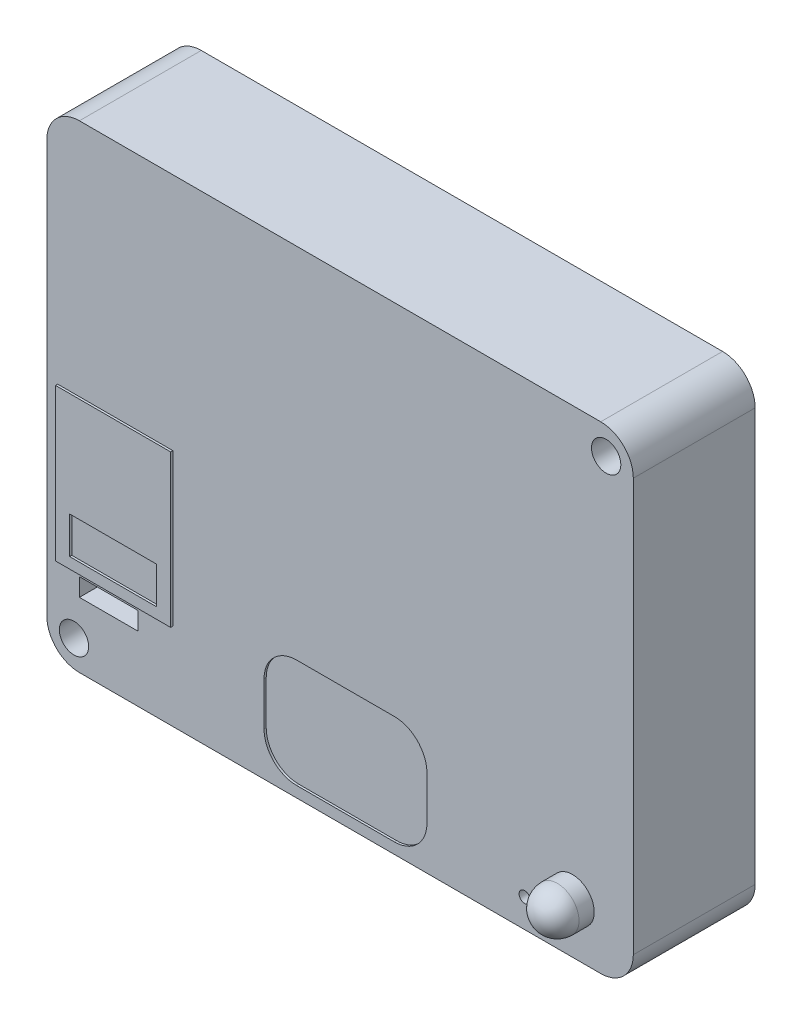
ISO-10303-21;
HEADER;
FILE_DESCRIPTION(('STEP AP214'),'2;1');
FILE_NAME('part.step','',(''),(''),'','','');
FILE_SCHEMA(('AUTOMOTIVE_DESIGN { 1 0 10303 214 1 1 1 1 }'));
ENDSEC;
DATA;
#1=APPLICATION_CONTEXT('core data for automotive mechanical design processes');
#2=APPLICATION_PROTOCOL_DEFINITION('international standard','automotive_design',2000,#1);
#3=PRODUCT_CONTEXT('',#1,'mechanical');
#4=PRODUCT('Part','Part','',(#3));
#5=PRODUCT_RELATED_PRODUCT_CATEGORY('part','',(#4));
#6=PRODUCT_DEFINITION_FORMATION('','',#4);
#7=PRODUCT_DEFINITION_CONTEXT('part definition',#1,'design');
#8=PRODUCT_DEFINITION('design','',#6,#7);
#9=PRODUCT_DEFINITION_SHAPE('','',#8);
#10=(LENGTH_UNIT() NAMED_UNIT(*) SI_UNIT(.MILLI.,.METRE.));
#11=(NAMED_UNIT(*) PLANE_ANGLE_UNIT() SI_UNIT($,.RADIAN.));
#12=(NAMED_UNIT(*) SI_UNIT($,.STERADIAN.) SOLID_ANGLE_UNIT());
#13=UNCERTAINTY_MEASURE_WITH_UNIT(LENGTH_MEASURE(1.E-05),#10,'distance_accuracy_value','');
#14=(GEOMETRIC_REPRESENTATION_CONTEXT(3) GLOBAL_UNCERTAINTY_ASSIGNED_CONTEXT((#13)) GLOBAL_UNIT_ASSIGNED_CONTEXT((#10,
#11,#12)) REPRESENTATION_CONTEXT('',''));
#15=CARTESIAN_POINT('',(0.,0.,0.));
#16=DIRECTION('',(0.,0.,1.));
#17=DIRECTION('',(1.,0.,0.));
#18=AXIS2_PLACEMENT_3D('',#15,#16,#17);
#19=CARTESIAN_POINT('',(0.,0.,14.2494));
#20=DIRECTION('',(0.,0.,1.));
#21=DIRECTION('',(1.,0.,0.));
#22=AXIS2_PLACEMENT_3D('',#19,#20,#21);
#23=PLANE('',#22);
#24=CARTESIAN_POINT('',(16.2602479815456,25.4739734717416,14.2494));
#25=DIRECTION('',(0.,0.,1.));
#26=DIRECTION('',(1.,0.,0.));
#27=AXIS2_PLACEMENT_3D('',#24,#25,#26);
#28=CIRCLE('',#27,1.7145);
#29=CARTESIAN_POINT('',(17.9747479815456,25.4739734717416,14.2494));
#30=VERTEX_POINT('',#29);
#31=EDGE_CURVE('E275',#30,#30,#28,.F.);
#32=ORIENTED_EDGE('',*,*,#31,.T.);
#33=EDGE_LOOP('',(#32));
#34=FACE_BOUND('',#33,.T.);
#35=CARTESIAN_POINT('',(6.73524798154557,-23.9290265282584,14.2494));
#36=DIRECTION('',(0.,0.,1.));
#37=DIRECTION('',(1.,0.,0.));
#38=AXIS2_PLACEMENT_3D('',#35,#36,#37);
#39=CIRCLE('',#38,0.65532019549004);
#40=CARTESIAN_POINT('',(7.39056817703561,-23.9290265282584,14.2494));
#41=VERTEX_POINT('',#40);
#42=EDGE_CURVE('E269',#41,#41,#39,.F.);
#43=ORIENTED_EDGE('',*,*,#42,.T.);
#44=EDGE_LOOP('',(#43));
#45=FACE_BOUND('',#44,.T.);
#46=CARTESIAN_POINT('',(-19.9347520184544,-17.0710265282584,14.2494));
#47=DIRECTION('',(0.,0.,1.));
#48=DIRECTION('',(1.,0.,0.));
#49=AXIS2_PLACEMENT_3D('',#46,#47,#48);
#50=CIRCLE('',#49,3.81);
#51=CARTESIAN_POINT('',(-23.7447520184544,-17.0710265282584,14.2494));
#52=VERTEX_POINT('',#51);
#53=CARTESIAN_POINT('',(-19.9347520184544,-13.2610265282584,14.2494));
#54=VERTEX_POINT('',#53);
#55=EDGE_CURVE('E260',#52,#54,#50,.F.);
#56=ORIENTED_EDGE('',*,*,#55,.T.);
#57=DIRECTION('',(1.,0.,0.));
#58=VECTOR('',#57,1.);
#59=CARTESIAN_POINT('',(-23.7447520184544,-13.2610265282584,14.2494));
#60=LINE('',#59,#58);
#61=CARTESIAN_POINT('',(-8.50475201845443,-13.2610265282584,14.2494));
#62=VERTEX_POINT('',#61);
#63=EDGE_CURVE('E256',#54,#62,#60,.T.);
#64=ORIENTED_EDGE('',*,*,#63,.T.);
#65=CARTESIAN_POINT('',(-8.50475201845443,-17.0710265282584,14.2494));
#66=DIRECTION('',(0.,0.,1.));
#67=DIRECTION('',(1.,0.,0.));
#68=AXIS2_PLACEMENT_3D('',#65,#66,#67);
#69=CIRCLE('',#68,3.81);
#70=CARTESIAN_POINT('',(-4.69475201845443,-17.0710265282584,14.2494));
#71=VERTEX_POINT('',#70);
#72=EDGE_CURVE('E254',#62,#71,#69,.F.);
#73=ORIENTED_EDGE('',*,*,#72,.T.);
#74=DIRECTION('',(0.,-1.,0.));
#75=VECTOR('',#74,1.);
#76=CARTESIAN_POINT('',(-4.69475201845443,-13.2610265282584,14.2494));
#77=LINE('',#76,#75);
#78=CARTESIAN_POINT('',(-4.69475201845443,-22.1510265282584,14.2494));
#79=VERTEX_POINT('',#78);
#80=EDGE_CURVE('E250',#71,#79,#77,.T.);
#81=ORIENTED_EDGE('',*,*,#80,.T.);
#82=CARTESIAN_POINT('',(-8.50475201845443,-22.1510265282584,14.2494));
#83=DIRECTION('',(0.,0.,1.));
#84=DIRECTION('',(1.,0.,0.));
#85=AXIS2_PLACEMENT_3D('',#82,#83,#84);
#86=CIRCLE('',#85,3.81);
#87=CARTESIAN_POINT('',(-8.50475201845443,-25.9610265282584,14.2494));
#88=VERTEX_POINT('',#87);
#89=EDGE_CURVE('E11',#79,#88,#86,.F.);
#90=ORIENTED_EDGE('',*,*,#89,.T.);
#91=DIRECTION('',(-1.,0.,0.));
#92=VECTOR('',#91,1.);
#93=CARTESIAN_POINT('',(-23.7447520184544,-25.9610265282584,14.2494));
#94=LINE('',#93,#92);
#95=CARTESIAN_POINT('',(-19.9347520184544,-25.9610265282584,14.2494));
#96=VERTEX_POINT('',#95);
#97=EDGE_CURVE('E248',#88,#96,#94,.T.);
#98=ORIENTED_EDGE('',*,*,#97,.T.);
#99=CARTESIAN_POINT('',(-19.9347520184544,-22.1510265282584,14.2494));
#100=DIRECTION('',(0.,0.,1.));
#101=DIRECTION('',(1.,0.,0.));
#102=AXIS2_PLACEMENT_3D('',#99,#100,#101);
#103=CIRCLE('',#102,3.81);
#104=CARTESIAN_POINT('',(-23.7447520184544,-22.1510265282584,14.2494));
#105=VERTEX_POINT('',#104);
#106=EDGE_CURVE('E252',#96,#105,#103,.F.);
#107=ORIENTED_EDGE('',*,*,#106,.T.);
#108=DIRECTION('',(0.,1.,0.));
#109=VECTOR('',#108,1.);
#110=CARTESIAN_POINT('',(-23.7447520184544,-13.2610265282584,14.2494));
#111=LINE('',#110,#109);
#112=EDGE_CURVE('E258',#105,#52,#111,.T.);
#113=ORIENTED_EDGE('',*,*,#112,.T.);
#114=EDGE_LOOP('',(#56,#64,#73,#81,#90,#98,#107,#113));
#115=FACE_BOUND('',#114,.T.);
#116=DIRECTION('',(-1.,0.,0.));
#117=VECTOR('',#116,1.);
#118=CARTESIAN_POINT('',(-47.8747520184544,0.70897347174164,14.2494));
#119=LINE('',#118,#117);
#120=CARTESIAN_POINT('',(-34.4127520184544,0.70897347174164,14.2494));
#121=VERTEX_POINT('',#120);
#122=CARTESIAN_POINT('',(-47.8747520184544,0.70897347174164,14.2494));
#123=VERTEX_POINT('',#122);
#124=EDGE_CURVE('E222',#121,#123,#119,.T.);
#125=ORIENTED_EDGE('',*,*,#124,.F.);
#126=DIRECTION('',(0.,1.,0.));
#127=VECTOR('',#126,1.);
#128=CARTESIAN_POINT('',(-34.4127520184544,-17.0710265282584,14.2494));
#129=LINE('',#128,#127);
#130=CARTESIAN_POINT('',(-34.4127520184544,-17.0710265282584,14.2494));
#131=VERTEX_POINT('',#130);
#132=EDGE_CURVE('E215',#131,#121,#129,.T.);
#133=ORIENTED_EDGE('',*,*,#132,.F.);
#134=DIRECTION('',(1.,0.,0.));
#135=VECTOR('',#134,1.);
#136=CARTESIAN_POINT('',(-47.8747520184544,-17.0710265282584,14.2494));
#137=LINE('',#136,#135);
#138=CARTESIAN_POINT('',(-47.8747520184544,-17.0710265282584,14.2494));
#139=VERTEX_POINT('',#138);
#140=EDGE_CURVE('E219',#139,#131,#137,.T.);
#141=ORIENTED_EDGE('',*,*,#140,.F.);
#142=DIRECTION('',(0.,-1.,0.));
#143=VECTOR('',#142,1.);
#144=CARTESIAN_POINT('',(-47.8747520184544,-17.0710265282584,14.2494));
#145=LINE('',#144,#143);
#146=EDGE_CURVE('E234',#123,#139,#145,.T.);
#147=ORIENTED_EDGE('',*,*,#146,.F.);
#148=EDGE_LOOP('',(#125,#133,#141,#147));
#149=FACE_BOUND('',#148,.T.);
#150=DIRECTION('',(0.,-1.,0.));
#151=VECTOR('',#150,1.);
#152=CARTESIAN_POINT('',(19.4352479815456,-27.2310265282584,14.2494));
#153=LINE('',#152,#151);
#154=CARTESIAN_POINT('',(19.4352479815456,24.8389734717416,14.2494));
#155=VERTEX_POINT('',#154);
#156=CARTESIAN_POINT('',(19.4352479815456,-23.4210265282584,14.2494));
#157=VERTEX_POINT('',#156);
#158=EDGE_CURVE('E404',#155,#157,#153,.T.);
#159=ORIENTED_EDGE('',*,*,#158,.F.);
#160=CARTESIAN_POINT('',(15.6252479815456,24.8389734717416,14.2494));
#161=DIRECTION('',(0.,0.,-1.));
#162=DIRECTION('',(-1.,0.,0.));
#163=AXIS2_PLACEMENT_3D('',#160,#161,#162);
#164=CIRCLE('',#163,3.81);
#165=CARTESIAN_POINT('',(15.6252479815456,28.6489734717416,14.2494));
#166=VERTEX_POINT('',#165);
#167=EDGE_CURVE('E401',#166,#155,#164,.T.);
#168=ORIENTED_EDGE('',*,*,#167,.F.);
#169=DIRECTION('',(1.,0.,0.));
#170=VECTOR('',#169,1.);
#171=CARTESIAN_POINT('',(-49.1447520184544,28.6489734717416,14.2494));
#172=LINE('',#171,#170);
#173=CARTESIAN_POINT('',(-45.3347520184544,28.6489734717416,14.2494));
#174=VERTEX_POINT('',#173);
#175=EDGE_CURVE('E398',#174,#166,#172,.T.);
#176=ORIENTED_EDGE('',*,*,#175,.F.);
#177=CARTESIAN_POINT('',(-45.3347520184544,24.8389734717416,14.2494));
#178=DIRECTION('',(0.,0.,-1.));
#179=DIRECTION('',(-1.,0.,0.));
#180=AXIS2_PLACEMENT_3D('',#177,#178,#179);
#181=CIRCLE('',#180,3.81);
#182=CARTESIAN_POINT('',(-49.1447520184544,24.8389734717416,14.2494));
#183=VERTEX_POINT('',#182);
#184=EDGE_CURVE('E395',#183,#174,#181,.T.);
#185=ORIENTED_EDGE('',*,*,#184,.F.);
#186=DIRECTION('',(0.,1.,0.));
#187=VECTOR('',#186,1.);
#188=CARTESIAN_POINT('',(-49.1447520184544,-27.2310265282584,14.2494));
#189=LINE('',#188,#187);
#190=CARTESIAN_POINT('',(-49.1447520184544,-23.4210265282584,14.2494));
#191=VERTEX_POINT('',#190);
#192=EDGE_CURVE('E416',#191,#183,#189,.T.);
#193=ORIENTED_EDGE('',*,*,#192,.F.);
#194=CARTESIAN_POINT('',(-45.3347520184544,-23.4210265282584,14.2494));
#195=DIRECTION('',(0.,0.,-1.));
#196=DIRECTION('',(-1.,0.,0.));
#197=AXIS2_PLACEMENT_3D('',#194,#195,#196);
#198=CIRCLE('',#197,3.81);
#199=CARTESIAN_POINT('',(-45.3347520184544,-27.2310265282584,14.2494));
#200=VERTEX_POINT('',#199);
#201=EDGE_CURVE('E413',#200,#191,#198,.T.);
#202=ORIENTED_EDGE('',*,*,#201,.F.);
#203=DIRECTION('',(-1.,0.,0.));
#204=VECTOR('',#203,1.);
#205=CARTESIAN_POINT('',(-49.1447520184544,-27.2310265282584,14.2494));
#206=LINE('',#205,#204);
#207=CARTESIAN_POINT('',(15.6252479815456,-27.2310265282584,14.2494));
#208=VERTEX_POINT('',#207);
#209=EDGE_CURVE('E410',#208,#200,#206,.T.);
#210=ORIENTED_EDGE('',*,*,#209,.F.);
#211=CARTESIAN_POINT('',(15.6252479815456,-23.4210265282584,14.2494));
#212=DIRECTION('',(0.,0.,-1.));
#213=DIRECTION('',(-1.,0.,0.));
#214=AXIS2_PLACEMENT_3D('',#211,#212,#213);
#215=CIRCLE('',#214,3.81);
#216=EDGE_CURVE('E407',#157,#208,#215,.T.);
#217=ORIENTED_EDGE('',*,*,#216,.F.);
#218=EDGE_LOOP('',(#159,#168,#176,#185,#193,#202,#210,#217));
#219=FACE_BOUND('',#218,.T.);
#220=DIRECTION('',(0.,1.,0.));
#221=VECTOR('',#220,1.);
#222=CARTESIAN_POINT('',(-45.3347520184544,-17.5155265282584,14.2494));
#223=LINE('',#222,#221);
#224=CARTESIAN_POINT('',(-45.3347520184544,-19.6110265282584,14.2494));
#225=VERTEX_POINT('',#224);
#226=CARTESIAN_POINT('',(-45.3347520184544,-17.5155265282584,14.2494));
#227=VERTEX_POINT('',#226);
#228=EDGE_CURVE('E267',#225,#227,#223,.T.);
#229=ORIENTED_EDGE('',*,*,#228,.T.);
#230=DIRECTION('',(1.,0.,0.));
#231=VECTOR('',#230,1.);
#232=CARTESIAN_POINT('',(-45.3347520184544,-17.5155265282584,14.2494));
#233=LINE('',#232,#231);
#234=CARTESIAN_POINT('',(-38.4767520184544,-17.5155265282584,14.2494));
#235=VERTEX_POINT('',#234);
#236=EDGE_CURVE('E265',#227,#235,#233,.T.);
#237=ORIENTED_EDGE('',*,*,#236,.T.);
#238=DIRECTION('',(0.,-1.,0.));
#239=VECTOR('',#238,1.);
#240=CARTESIAN_POINT('',(-38.4767520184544,-17.5155265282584,14.2494));
#241=LINE('',#240,#239);
#242=CARTESIAN_POINT('',(-38.4767520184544,-19.6110265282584,14.2494));
#243=VERTEX_POINT('',#242);
#244=EDGE_CURVE('E52',#235,#243,#241,.T.);
#245=ORIENTED_EDGE('',*,*,#244,.T.);
#246=DIRECTION('',(-1.,0.,0.));
#247=VECTOR('',#246,1.);
#248=CARTESIAN_POINT('',(-45.3347520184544,-19.6110265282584,14.2494));
#249=LINE('',#248,#247);
#250=EDGE_CURVE('E262',#243,#225,#249,.T.);
#251=ORIENTED_EDGE('',*,*,#250,.T.);
#252=EDGE_LOOP('',(#229,#237,#245,#251));
#253=FACE_BOUND('',#252,.T.);
#254=CARTESIAN_POINT('',(-45.9697520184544,-24.0560265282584,14.2494));
#255=DIRECTION('',(0.,0.,1.));
#256=DIRECTION('',(1.,0.,0.));
#257=AXIS2_PLACEMENT_3D('',#254,#255,#256);
#258=CIRCLE('',#257,1.7145);
#259=CARTESIAN_POINT('',(-44.2552520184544,-24.0560265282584,14.2494));
#260=VERTEX_POINT('',#259);
#261=EDGE_CURVE('E272',#260,#260,#258,.F.);
#262=ORIENTED_EDGE('',*,*,#261,.T.);
#263=EDGE_LOOP('',(#262));
#264=FACE_BOUND('',#263,.T.);
#265=CARTESIAN_POINT('',(12.3232479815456,-21.3890265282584,14.2494));
#266=DIRECTION('',(0.,0.,1.));
#267=DIRECTION('',(1.,0.,0.));
#268=AXIS2_PLACEMENT_3D('',#265,#266,#267);
#269=CIRCLE('',#268,2.54);
#270=CARTESIAN_POINT('',(14.8632479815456,-21.3890265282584,14.2494));
#271=VERTEX_POINT('',#270);
#272=EDGE_CURVE('E716',#271,#271,#269,.T.);
#273=ORIENTED_EDGE('',*,*,#272,.F.);
#274=EDGE_LOOP('',(#273));
#275=FACE_BOUND('',#274,.T.);
#276=ADVANCED_FACE('F29',(#34,#45,#115,#149,#219,#253,#264,#275),#23,.T.);
#277=CARTESIAN_POINT('',(-49.1447520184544,28.6489734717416,14.5034));
#278=DIRECTION('',(0.,0.,-1.));
#279=DIRECTION('',(-1.,0.,0.));
#280=AXIS2_PLACEMENT_3D('',#277,#278,#279);
#281=PLANE('',#280);
#282=DIRECTION('',(1.,0.,0.));
#283=VECTOR('',#282,1.);
#284=CARTESIAN_POINT('',(-46.2237520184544,-15.8010265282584,14.5034));
#285=LINE('',#284,#283);
#286=CARTESIAN_POINT('',(-46.2237520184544,-15.8010265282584,14.5034));
#287=VERTEX_POINT('',#286);
#288=CARTESIAN_POINT('',(-36.0637520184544,-15.8010265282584,14.5034));
#289=VERTEX_POINT('',#288);
#290=EDGE_CURVE('E280',#287,#289,#285,.T.);
#291=ORIENTED_EDGE('',*,*,#290,.F.);
#292=DIRECTION('',(0.,-1.,0.));
#293=VECTOR('',#292,1.);
#294=CARTESIAN_POINT('',(-46.2237520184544,-15.8010265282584,14.5034));
#295=LINE('',#294,#293);
#296=CARTESIAN_POINT('',(-46.2237520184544,-11.4830265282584,14.5034));
#297=VERTEX_POINT('',#296);
#298=EDGE_CURVE('E278',#297,#287,#295,.T.);
#299=ORIENTED_EDGE('',*,*,#298,.F.);
#300=DIRECTION('',(-1.,0.,0.));
#301=VECTOR('',#300,1.);
#302=CARTESIAN_POINT('',(-46.2237520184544,-11.4830265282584,14.5034));
#303=LINE('',#302,#301);
#304=CARTESIAN_POINT('',(-36.0637520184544,-11.4830265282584,14.5034));
#305=VERTEX_POINT('',#304);
#306=EDGE_CURVE('E286',#305,#297,#303,.T.);
#307=ORIENTED_EDGE('',*,*,#306,.F.);
#308=DIRECTION('',(0.,1.,0.));
#309=VECTOR('',#308,1.);
#310=CARTESIAN_POINT('',(-36.0637520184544,-15.8010265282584,14.5034));
#311=LINE('',#310,#309);
#312=EDGE_CURVE('E283',#289,#305,#311,.T.);
#313=ORIENTED_EDGE('',*,*,#312,.F.);
#314=EDGE_LOOP('',(#291,#299,#307,#313));
#315=FACE_BOUND('',#314,.T.);
#316=DIRECTION('',(0.,-1.,0.));
#317=VECTOR('',#316,1.);
#318=CARTESIAN_POINT('',(-47.8747520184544,-17.0710265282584,14.5034));
#319=LINE('',#318,#317);
#320=CARTESIAN_POINT('',(-47.8747520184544,0.70897347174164,14.5034));
#321=VERTEX_POINT('',#320);
#322=CARTESIAN_POINT('',(-47.8747520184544,-17.0710265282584,14.5034));
#323=VERTEX_POINT('',#322);
#324=EDGE_CURVE('E223',#321,#323,#319,.T.);
#325=ORIENTED_EDGE('',*,*,#324,.T.);
#326=DIRECTION('',(1.,0.,0.));
#327=VECTOR('',#326,1.);
#328=CARTESIAN_POINT('',(-47.8747520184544,-17.0710265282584,14.5034));
#329=LINE('',#328,#327);
#330=CARTESIAN_POINT('',(-34.4127520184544,-17.0710265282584,14.5034));
#331=VERTEX_POINT('',#330);
#332=EDGE_CURVE('E230',#323,#331,#329,.T.);
#333=ORIENTED_EDGE('',*,*,#332,.T.);
#334=DIRECTION('',(0.,1.,0.));
#335=VECTOR('',#334,1.);
#336=CARTESIAN_POINT('',(-34.4127520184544,-17.0710265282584,14.5034));
#337=LINE('',#336,#335);
#338=CARTESIAN_POINT('',(-34.4127520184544,0.70897347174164,14.5034));
#339=VERTEX_POINT('',#338);
#340=EDGE_CURVE('E44',#331,#339,#337,.T.);
#341=ORIENTED_EDGE('',*,*,#340,.T.);
#342=DIRECTION('',(-1.,0.,0.));
#343=VECTOR('',#342,1.);
#344=CARTESIAN_POINT('',(-47.8747520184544,0.70897347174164,14.5034));
#345=LINE('',#344,#343);
#346=EDGE_CURVE('E239',#339,#321,#345,.T.);
#347=ORIENTED_EDGE('',*,*,#346,.T.);
#348=EDGE_LOOP('',(#325,#333,#341,#347));
#349=FACE_BOUND('',#348,.T.);
#350=ADVANCED_FACE('F498',(#315,#349),#281,.F.);
#351=CARTESIAN_POINT('',(-46.2237520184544,-15.8010265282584,14.2494));
#352=DIRECTION('',(-1.,0.,0.));
#353=DIRECTION('',(0.,0.,1.));
#354=AXIS2_PLACEMENT_3D('',#351,#352,#353);
#355=PLANE('',#354);
#356=ORIENTED_EDGE('',*,*,#298,.T.);
#357=DIRECTION('',(0.,0.,1.));
#358=VECTOR('',#357,1.);
#359=CARTESIAN_POINT('',(-46.2237520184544,-15.8010265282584,14.2494));
#360=LINE('',#359,#358);
#361=CARTESIAN_POINT('',(-46.2237520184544,-15.8010265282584,14.2494));
#362=VERTEX_POINT('',#361);
#363=EDGE_CURVE('E301',#362,#287,#360,.T.);
#364=ORIENTED_EDGE('',*,*,#363,.F.);
#365=DIRECTION('',(0.,-1.,0.));
#366=VECTOR('',#365,1.);
#367=CARTESIAN_POINT('',(-46.2237520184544,-15.8010265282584,14.2494));
#368=LINE('',#367,#366);
#369=CARTESIAN_POINT('',(-46.2237520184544,-11.4830265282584,14.2494));
#370=VERTEX_POINT('',#369);
#371=EDGE_CURVE('E289',#370,#362,#368,.T.);
#372=ORIENTED_EDGE('',*,*,#371,.F.);
#373=DIRECTION('',(0.,0.,1.));
#374=VECTOR('',#373,1.);
#375=CARTESIAN_POINT('',(-46.2237520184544,-11.4830265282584,14.2494));
#376=LINE('',#375,#374);
#377=EDGE_CURVE('E302',#370,#297,#376,.T.);
#378=ORIENTED_EDGE('',*,*,#377,.T.);
#379=EDGE_LOOP('',(#356,#364,#372,#378));
#380=FACE_BOUND('',#379,.T.);
#381=ADVANCED_FACE('F504',(#380),#355,.F.);
#382=CARTESIAN_POINT('',(-46.2237520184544,-11.4830265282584,14.2494));
#383=DIRECTION('',(0.,1.,0.));
#384=DIRECTION('',(-1.,0.,0.));
#385=AXIS2_PLACEMENT_3D('',#382,#383,#384);
#386=PLANE('',#385);
#387=ORIENTED_EDGE('',*,*,#306,.T.);
#388=ORIENTED_EDGE('',*,*,#377,.F.);
#389=DIRECTION('',(-1.,0.,0.));
#390=VECTOR('',#389,1.);
#391=CARTESIAN_POINT('',(-46.2237520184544,-11.4830265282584,14.2494));
#392=LINE('',#391,#390);
#393=CARTESIAN_POINT('',(-36.0637520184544,-11.4830265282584,14.2494));
#394=VERTEX_POINT('',#393);
#395=EDGE_CURVE('E298',#394,#370,#392,.T.);
#396=ORIENTED_EDGE('',*,*,#395,.F.);
#397=DIRECTION('',(0.,0.,1.));
#398=VECTOR('',#397,1.);
#399=CARTESIAN_POINT('',(-36.0637520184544,-11.4830265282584,14.2494));
#400=LINE('',#399,#398);
#401=EDGE_CURVE('E305',#394,#305,#400,.T.);
#402=ORIENTED_EDGE('',*,*,#401,.T.);
#403=EDGE_LOOP('',(#387,#388,#396,#402));
#404=FACE_BOUND('',#403,.T.);
#405=ADVANCED_FACE('F529',(#404),#386,.F.);
#406=CARTESIAN_POINT('',(-36.0637520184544,-15.8010265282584,14.2494));
#407=DIRECTION('',(1.,0.,0.));
#408=DIRECTION('',(0.,0.,-1.));
#409=AXIS2_PLACEMENT_3D('',#406,#407,#408);
#410=PLANE('',#409);
#411=ORIENTED_EDGE('',*,*,#312,.T.);
#412=ORIENTED_EDGE('',*,*,#401,.F.);
#413=DIRECTION('',(0.,1.,0.));
#414=VECTOR('',#413,1.);
#415=CARTESIAN_POINT('',(-36.0637520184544,-15.8010265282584,14.2494));
#416=LINE('',#415,#414);
#417=CARTESIAN_POINT('',(-36.0637520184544,-15.8010265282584,14.2494));
#418=VERTEX_POINT('',#417);
#419=EDGE_CURVE('E295',#418,#394,#416,.T.);
#420=ORIENTED_EDGE('',*,*,#419,.F.);
#421=DIRECTION('',(0.,0.,1.));
#422=VECTOR('',#421,1.);
#423=CARTESIAN_POINT('',(-36.0637520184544,-15.8010265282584,14.2494));
#424=LINE('',#423,#422);
#425=EDGE_CURVE('E307',#418,#289,#424,.T.);
#426=ORIENTED_EDGE('',*,*,#425,.T.);
#427=EDGE_LOOP('',(#411,#412,#420,#426));
#428=FACE_BOUND('',#427,.T.);
#429=ADVANCED_FACE('F532',(#428),#410,.F.);
#430=CARTESIAN_POINT('',(-46.2237520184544,-15.8010265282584,14.2494));
#431=DIRECTION('',(0.,-1.,0.));
#432=DIRECTION('',(0.,0.,-1.));
#433=AXIS2_PLACEMENT_3D('',#430,#431,#432);
#434=PLANE('',#433);
#435=ORIENTED_EDGE('',*,*,#290,.T.);
#436=ORIENTED_EDGE('',*,*,#425,.F.);
#437=DIRECTION('',(1.,0.,0.));
#438=VECTOR('',#437,1.);
#439=CARTESIAN_POINT('',(-46.2237520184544,-15.8010265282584,14.2494));
#440=LINE('',#439,#438);
#441=EDGE_CURVE('E292',#362,#418,#440,.T.);
#442=ORIENTED_EDGE('',*,*,#441,.F.);
#443=ORIENTED_EDGE('',*,*,#363,.T.);
#444=EDGE_LOOP('',(#435,#436,#442,#443));
#445=FACE_BOUND('',#444,.T.);
#446=ADVANCED_FACE('F527',(#445),#434,.F.);
#447=CARTESIAN_POINT('',(-46.2237520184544,-15.8010265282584,14.2494));
#448=DIRECTION('',(0.,0.,-1.));
#449=DIRECTION('',(-1.,0.,0.));
#450=AXIS2_PLACEMENT_3D('',#447,#448,#449);
#451=PLANE('',#450);
#452=ORIENTED_EDGE('',*,*,#371,.T.);
#453=ORIENTED_EDGE('',*,*,#441,.T.);
#454=ORIENTED_EDGE('',*,*,#419,.T.);
#455=ORIENTED_EDGE('',*,*,#395,.T.);
#456=EDGE_LOOP('',(#452,#453,#454,#455));
#457=FACE_BOUND('',#456,.T.);
#458=ADVANCED_FACE('F515',(#457),#451,.F.);
#459=CARTESIAN_POINT('',(-47.8747520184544,-17.0710265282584,14.2494));
#460=DIRECTION('',(-1.,0.,0.));
#461=DIRECTION('',(0.,0.,1.));
#462=AXIS2_PLACEMENT_3D('',#459,#460,#461);
#463=PLANE('',#462);
#464=ORIENTED_EDGE('',*,*,#324,.F.);
#465=DIRECTION('',(0.,0.,1.));
#466=VECTOR('',#465,1.);
#467=CARTESIAN_POINT('',(-47.8747520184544,0.70897347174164,14.2494));
#468=LINE('',#467,#466);
#469=EDGE_CURVE('E243',#123,#321,#468,.T.);
#470=ORIENTED_EDGE('',*,*,#469,.F.);
#471=ORIENTED_EDGE('',*,*,#146,.T.);
#472=DIRECTION('',(0.,0.,1.));
#473=VECTOR('',#472,1.);
#474=CARTESIAN_POINT('',(-47.8747520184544,-17.0710265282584,14.2494));
#475=LINE('',#474,#473);
#476=EDGE_CURVE('E233',#139,#323,#475,.T.);
#477=ORIENTED_EDGE('',*,*,#476,.T.);
#478=EDGE_LOOP('',(#464,#470,#471,#477));
#479=FACE_BOUND('',#478,.T.);
#480=ADVANCED_FACE('F511',(#479),#463,.T.);
#481=CARTESIAN_POINT('',(-47.8747520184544,0.70897347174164,14.2494));
#482=DIRECTION('',(0.,1.,0.));
#483=DIRECTION('',(0.,0.,1.));
#484=AXIS2_PLACEMENT_3D('',#481,#482,#483);
#485=PLANE('',#484);
#486=ORIENTED_EDGE('',*,*,#346,.F.);
#487=DIRECTION('',(0.,0.,1.));
#488=VECTOR('',#487,1.);
#489=CARTESIAN_POINT('',(-34.4127520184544,0.70897347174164,14.2494));
#490=LINE('',#489,#488);
#491=EDGE_CURVE('E242',#121,#339,#490,.T.);
#492=ORIENTED_EDGE('',*,*,#491,.F.);
#493=ORIENTED_EDGE('',*,*,#124,.T.);
#494=ORIENTED_EDGE('',*,*,#469,.T.);
#495=EDGE_LOOP('',(#486,#492,#493,#494));
#496=FACE_BOUND('',#495,.T.);
#497=ADVANCED_FACE('F514',(#496),#485,.T.);
#498=CARTESIAN_POINT('',(-34.4127520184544,-17.0710265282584,14.2494));
#499=DIRECTION('',(1.,0.,0.));
#500=DIRECTION('',(0.,0.,-1.));
#501=AXIS2_PLACEMENT_3D('',#498,#499,#500);
#502=PLANE('',#501);
#503=ORIENTED_EDGE('',*,*,#340,.F.);
#504=DIRECTION('',(0.,0.,1.));
#505=VECTOR('',#504,1.);
#506=CARTESIAN_POINT('',(-34.4127520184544,-17.0710265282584,14.2494));
#507=LINE('',#506,#505);
#508=EDGE_CURVE('E225',#131,#331,#507,.T.);
#509=ORIENTED_EDGE('',*,*,#508,.F.);
#510=ORIENTED_EDGE('',*,*,#132,.T.);
#511=ORIENTED_EDGE('',*,*,#491,.T.);
#512=EDGE_LOOP('',(#503,#509,#510,#511));
#513=FACE_BOUND('',#512,.T.);
#514=ADVANCED_FACE('F226',(#513),#502,.T.);
#515=CARTESIAN_POINT('',(-47.8747520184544,-17.0710265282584,14.2494));
#516=DIRECTION('',(0.,-1.,0.));
#517=DIRECTION('',(0.,0.,-1.));
#518=AXIS2_PLACEMENT_3D('',#515,#516,#517);
#519=PLANE('',#518);
#520=ORIENTED_EDGE('',*,*,#332,.F.);
#521=ORIENTED_EDGE('',*,*,#476,.F.);
#522=ORIENTED_EDGE('',*,*,#140,.T.);
#523=ORIENTED_EDGE('',*,*,#508,.T.);
#524=EDGE_LOOP('',(#520,#521,#522,#523));
#525=FACE_BOUND('',#524,.T.);
#526=ADVANCED_FACE('F232',(#525),#519,.T.);
#527=CARTESIAN_POINT('',(16.2602479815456,25.4739734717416,0.));
#528=DIRECTION('',(0.,0.,1.));
#529=DIRECTION('',(1.,0.,0.));
#530=AXIS2_PLACEMENT_3D('',#527,#528,#529);
#531=CYLINDRICAL_SURFACE('',#530,1.7145);
#532=CARTESIAN_POINT('',(16.2602479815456,25.4739734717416,0.));
#533=DIRECTION('',(0.,0.,1.));
#534=DIRECTION('',(1.,0.,0.));
#535=AXIS2_PLACEMENT_3D('',#532,#533,#534);
#536=CIRCLE('',#535,1.7145);
#537=CARTESIAN_POINT('',(17.9747479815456,25.4739734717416,0.));
#538=VERTEX_POINT('',#537);
#539=EDGE_CURVE('E352',#538,#538,#536,.T.);
#540=ORIENTED_EDGE('',*,*,#539,.F.);
#541=EDGE_LOOP('',(#540));
#542=FACE_BOUND('',#541,.T.);
#543=ORIENTED_EDGE('',*,*,#31,.F.);
#544=EDGE_LOOP('',(#543));
#545=FACE_BOUND('',#544,.T.);
#546=ADVANCED_FACE('F519',(#542,#545),#531,.F.);
#547=CARTESIAN_POINT('',(-45.9697520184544,-24.0560265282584,0.));
#548=DIRECTION('',(0.,0.,1.));
#549=DIRECTION('',(1.,0.,0.));
#550=AXIS2_PLACEMENT_3D('',#547,#548,#549);
#551=CYLINDRICAL_SURFACE('',#550,1.7145);
#552=CARTESIAN_POINT('',(-45.9697520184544,-24.0560265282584,0.));
#553=DIRECTION('',(0.,0.,1.));
#554=DIRECTION('',(1.,0.,0.));
#555=AXIS2_PLACEMENT_3D('',#552,#553,#554);
#556=CIRCLE('',#555,1.7145);
#557=CARTESIAN_POINT('',(-44.2552520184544,-24.0560265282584,0.));
#558=VERTEX_POINT('',#557);
#559=EDGE_CURVE('E349',#558,#558,#556,.T.);
#560=ORIENTED_EDGE('',*,*,#559,.F.);
#561=EDGE_LOOP('',(#560));
#562=FACE_BOUND('',#561,.T.);
#563=ORIENTED_EDGE('',*,*,#261,.F.);
#564=EDGE_LOOP('',(#563));
#565=FACE_BOUND('',#564,.T.);
#566=ADVANCED_FACE('F558',(#562,#565),#551,.F.);
#567=CARTESIAN_POINT('',(-49.1447520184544,28.6489734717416,0.));
#568=DIRECTION('',(0.,0.,-1.));
#569=DIRECTION('',(-1.,0.,0.));
#570=AXIS2_PLACEMENT_3D('',#567,#568,#569);
#571=PLANE('',#570);
#572=ORIENTED_EDGE('',*,*,#559,.T.);
#573=EDGE_LOOP('',(#572));
#574=FACE_BOUND('',#573,.T.);
#575=ORIENTED_EDGE('',*,*,#539,.T.);
#576=EDGE_LOOP('',(#575));
#577=FACE_BOUND('',#576,.T.);
#578=DIRECTION('',(0.,-1.,0.));
#579=VECTOR('',#578,1.);
#580=CARTESIAN_POINT('',(-49.1447520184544,-27.2310265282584,0.));
#581=LINE('',#580,#579);
#582=CARTESIAN_POINT('',(-49.1447520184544,24.8389734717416,0.));
#583=VERTEX_POINT('',#582);
#584=CARTESIAN_POINT('',(-49.1447520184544,-23.4210265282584,0.));
#585=VERTEX_POINT('',#584);
#586=EDGE_CURVE('E355',#583,#585,#581,.T.);
#587=ORIENTED_EDGE('',*,*,#586,.F.);
#588=CARTESIAN_POINT('',(-45.3347520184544,24.8389734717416,0.));
#589=DIRECTION('',(0.,0.,-1.));
#590=DIRECTION('',(-1.,0.,0.));
#591=AXIS2_PLACEMENT_3D('',#588,#589,#590);
#592=CIRCLE('',#591,3.81);
#593=CARTESIAN_POINT('',(-45.3347520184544,28.6489734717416,0.));
#594=VERTEX_POINT('',#593);
#595=EDGE_CURVE('E378',#583,#594,#592,.T.);
#596=ORIENTED_EDGE('',*,*,#595,.T.);
#597=DIRECTION('',(-1.,0.,0.));
#598=VECTOR('',#597,1.);
#599=CARTESIAN_POINT('',(-49.1447520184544,28.6489734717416,0.));
#600=LINE('',#599,#598);
#601=CARTESIAN_POINT('',(15.6252479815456,28.6489734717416,0.));
#602=VERTEX_POINT('',#601);
#603=EDGE_CURVE('E364',#602,#594,#600,.T.);
#604=ORIENTED_EDGE('',*,*,#603,.F.);
#605=CARTESIAN_POINT('',(15.6252479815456,24.8389734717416,0.));
#606=DIRECTION('',(0.,0.,-1.));
#607=DIRECTION('',(-1.,0.,0.));
#608=AXIS2_PLACEMENT_3D('',#605,#606,#607);
#609=CIRCLE('',#608,3.81);
#610=CARTESIAN_POINT('',(19.4352479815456,24.8389734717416,0.));
#611=VERTEX_POINT('',#610);
#612=EDGE_CURVE('E376',#602,#611,#609,.T.);
#613=ORIENTED_EDGE('',*,*,#612,.T.);
#614=DIRECTION('',(0.,1.,0.));
#615=VECTOR('',#614,1.);
#616=CARTESIAN_POINT('',(19.4352479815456,-27.2310265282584,0.));
#617=LINE('',#616,#615);
#618=CARTESIAN_POINT('',(19.4352479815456,-23.4210265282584,0.));
#619=VERTEX_POINT('',#618);
#620=EDGE_CURVE('E361',#619,#611,#617,.T.);
#621=ORIENTED_EDGE('',*,*,#620,.F.);
#622=CARTESIAN_POINT('',(15.6252479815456,-23.4210265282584,0.));
#623=DIRECTION('',(0.,0.,-1.));
#624=DIRECTION('',(-1.,0.,0.));
#625=AXIS2_PLACEMENT_3D('',#622,#623,#624);
#626=CIRCLE('',#625,3.81);
#627=CARTESIAN_POINT('',(15.6252479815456,-27.2310265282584,0.));
#628=VERTEX_POINT('',#627);
#629=EDGE_CURVE('E374',#619,#628,#626,.T.);
#630=ORIENTED_EDGE('',*,*,#629,.T.);
#631=DIRECTION('',(1.,0.,0.));
#632=VECTOR('',#631,1.);
#633=CARTESIAN_POINT('',(-49.1447520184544,-27.2310265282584,0.));
#634=LINE('',#633,#632);
#635=CARTESIAN_POINT('',(-45.3347520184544,-27.2310265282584,0.));
#636=VERTEX_POINT('',#635);
#637=EDGE_CURVE('E358',#636,#628,#634,.T.);
#638=ORIENTED_EDGE('',*,*,#637,.F.);
#639=CARTESIAN_POINT('',(-45.3347520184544,-23.4210265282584,0.));
#640=DIRECTION('',(0.,0.,-1.));
#641=DIRECTION('',(-1.,0.,0.));
#642=AXIS2_PLACEMENT_3D('',#639,#640,#641);
#643=CIRCLE('',#642,3.81);
#644=EDGE_CURVE('E372',#636,#585,#643,.T.);
#645=ORIENTED_EDGE('',*,*,#644,.T.);
#646=EDGE_LOOP('',(#587,#596,#604,#613,#621,#630,#638,#645));
#647=FACE_BOUND('',#646,.T.);
#648=ADVANCED_FACE('F561',(#574,#577,#647),#571,.T.);
#649=CARTESIAN_POINT('',(-45.3347520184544,24.8389734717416,14.5034));
#650=DIRECTION('',(0.,0.,-1.));
#651=DIRECTION('',(-1.,0.,0.));
#652=AXIS2_PLACEMENT_3D('',#649,#650,#651);
#653=CYLINDRICAL_SURFACE('',#652,3.81);
#654=DIRECTION('',(0.,0.,-1.));
#655=VECTOR('',#654,1.);
#656=CARTESIAN_POINT('',(-49.1447520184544,24.8389734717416,14.5034));
#657=LINE('',#656,#655);
#658=EDGE_CURVE('E370',#183,#583,#657,.T.);
#659=ORIENTED_EDGE('',*,*,#658,.F.);
#660=ORIENTED_EDGE('',*,*,#184,.T.);
#661=DIRECTION('',(0.,0.,-1.));
#662=VECTOR('',#661,1.);
#663=CARTESIAN_POINT('',(-45.3347520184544,28.6489734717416,14.5034));
#664=LINE('',#663,#662);
#665=EDGE_CURVE('E382',#594,#174,#664,.F.);
#666=ORIENTED_EDGE('',*,*,#665,.F.);
#667=ORIENTED_EDGE('',*,*,#595,.F.);
#668=EDGE_LOOP('',(#659,#660,#666,#667));
#669=FACE_BOUND('',#668,.T.);
#670=ADVANCED_FACE('F567',(#669),#653,.T.);
#671=CARTESIAN_POINT('',(-49.1447520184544,-27.2310265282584,14.5034));
#672=DIRECTION('',(1.,0.,0.));
#673=DIRECTION('',(0.,0.,-1.));
#674=AXIS2_PLACEMENT_3D('',#671,#672,#673);
#675=PLANE('',#674);
#676=DIRECTION('',(0.,0.,-1.));
#677=VECTOR('',#676,1.);
#678=CARTESIAN_POINT('',(-49.1447520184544,-23.4210265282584,14.5034));
#679=LINE('',#678,#677);
#680=EDGE_CURVE('E367',#585,#191,#679,.F.);
#681=ORIENTED_EDGE('',*,*,#680,.T.);
#682=ORIENTED_EDGE('',*,*,#192,.T.);
#683=ORIENTED_EDGE('',*,*,#658,.T.);
#684=ORIENTED_EDGE('',*,*,#586,.T.);
#685=EDGE_LOOP('',(#681,#682,#683,#684));
#686=FACE_BOUND('',#685,.T.);
#687=ADVANCED_FACE('F574',(#686),#675,.F.);
#688=CARTESIAN_POINT('',(-49.1447520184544,28.6489734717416,14.5034));
#689=DIRECTION('',(0.,-1.,0.));
#690=DIRECTION('',(0.,0.,-1.));
#691=AXIS2_PLACEMENT_3D('',#688,#689,#690);
#692=PLANE('',#691);
#693=ORIENTED_EDGE('',*,*,#665,.T.);
#694=ORIENTED_EDGE('',*,*,#175,.T.);
#695=DIRECTION('',(0.,0.,-1.));
#696=VECTOR('',#695,1.);
#697=CARTESIAN_POINT('',(15.6252479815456,28.6489734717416,14.5034));
#698=LINE('',#697,#696);
#699=EDGE_CURVE('E380',#166,#602,#698,.T.);
#700=ORIENTED_EDGE('',*,*,#699,.T.);
#701=ORIENTED_EDGE('',*,*,#603,.T.);
#702=EDGE_LOOP('',(#693,#694,#700,#701));
#703=FACE_BOUND('',#702,.T.);
#704=ADVANCED_FACE('F570',(#703),#692,.F.);
#705=CARTESIAN_POINT('',(-45.3347520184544,-23.4210265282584,14.5034));
#706=DIRECTION('',(0.,0.,-1.));
#707=DIRECTION('',(-1.,0.,0.));
#708=AXIS2_PLACEMENT_3D('',#705,#706,#707);
#709=CYLINDRICAL_SURFACE('',#708,3.81);
#710=DIRECTION('',(0.,0.,-1.));
#711=VECTOR('',#710,1.);
#712=CARTESIAN_POINT('',(-45.3347520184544,-27.2310265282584,14.5034));
#713=LINE('',#712,#711);
#714=EDGE_CURVE('E390',#200,#636,#713,.T.);
#715=ORIENTED_EDGE('',*,*,#714,.F.);
#716=ORIENTED_EDGE('',*,*,#201,.T.);
#717=ORIENTED_EDGE('',*,*,#680,.F.);
#718=ORIENTED_EDGE('',*,*,#644,.F.);
#719=EDGE_LOOP('',(#715,#716,#717,#718));
#720=FACE_BOUND('',#719,.T.);
#721=ADVANCED_FACE('F573',(#720),#709,.T.);
#722=CARTESIAN_POINT('',(15.6252479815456,24.8389734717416,14.5034));
#723=DIRECTION('',(0.,0.,-1.));
#724=DIRECTION('',(-1.,0.,0.));
#725=AXIS2_PLACEMENT_3D('',#722,#723,#724);
#726=CYLINDRICAL_SURFACE('',#725,3.81);
#727=ORIENTED_EDGE('',*,*,#699,.F.);
#728=ORIENTED_EDGE('',*,*,#167,.T.);
#729=DIRECTION('',(0.,0.,-1.));
#730=VECTOR('',#729,1.);
#731=CARTESIAN_POINT('',(19.4352479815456,24.8389734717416,14.5034));
#732=LINE('',#731,#730);
#733=EDGE_CURVE('E387',#611,#155,#732,.F.);
#734=ORIENTED_EDGE('',*,*,#733,.F.);
#735=ORIENTED_EDGE('',*,*,#612,.F.);
#736=EDGE_LOOP('',(#727,#728,#734,#735));
#737=FACE_BOUND('',#736,.T.);
#738=ADVANCED_FACE('F583',(#737),#726,.T.);
#739=CARTESIAN_POINT('',(-49.1447520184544,-27.2310265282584,14.5034));
#740=DIRECTION('',(0.,1.,0.));
#741=DIRECTION('',(0.,0.,1.));
#742=AXIS2_PLACEMENT_3D('',#739,#740,#741);
#743=PLANE('',#742);
#744=DIRECTION('',(0.,0.,-1.));
#745=VECTOR('',#744,1.);
#746=CARTESIAN_POINT('',(15.6252479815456,-27.2310265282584,14.5034));
#747=LINE('',#746,#745);
#748=EDGE_CURVE('E392',#628,#208,#747,.F.);
#749=ORIENTED_EDGE('',*,*,#748,.T.);
#750=ORIENTED_EDGE('',*,*,#209,.T.);
#751=ORIENTED_EDGE('',*,*,#714,.T.);
#752=ORIENTED_EDGE('',*,*,#637,.T.);
#753=EDGE_LOOP('',(#749,#750,#751,#752));
#754=FACE_BOUND('',#753,.T.);
#755=ADVANCED_FACE('F580',(#754),#743,.F.);
#756=CARTESIAN_POINT('',(19.4352479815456,-27.2310265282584,14.5034));
#757=DIRECTION('',(-1.,0.,0.));
#758=DIRECTION('',(0.,0.,1.));
#759=AXIS2_PLACEMENT_3D('',#756,#757,#758);
#760=PLANE('',#759);
#761=ORIENTED_EDGE('',*,*,#733,.T.);
#762=ORIENTED_EDGE('',*,*,#158,.T.);
#763=DIRECTION('',(0.,0.,-1.));
#764=VECTOR('',#763,1.);
#765=CARTESIAN_POINT('',(19.4352479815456,-23.4210265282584,14.5034));
#766=LINE('',#765,#764);
#767=EDGE_CURVE('E385',#157,#619,#766,.T.);
#768=ORIENTED_EDGE('',*,*,#767,.T.);
#769=ORIENTED_EDGE('',*,*,#620,.T.);
#770=EDGE_LOOP('',(#761,#762,#768,#769));
#771=FACE_BOUND('',#770,.T.);
#772=ADVANCED_FACE('F576',(#771),#760,.F.);
#773=CARTESIAN_POINT('',(15.6252479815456,-23.4210265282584,14.5034));
#774=DIRECTION('',(0.,0.,-1.));
#775=DIRECTION('',(-1.,0.,0.));
#776=AXIS2_PLACEMENT_3D('',#773,#774,#775);
#777=CYLINDRICAL_SURFACE('',#776,3.81);
#778=ORIENTED_EDGE('',*,*,#767,.F.);
#779=ORIENTED_EDGE('',*,*,#216,.T.);
#780=ORIENTED_EDGE('',*,*,#748,.F.);
#781=ORIENTED_EDGE('',*,*,#629,.F.);
#782=EDGE_LOOP('',(#778,#779,#780,#781));
#783=FACE_BOUND('',#782,.T.);
#784=ADVANCED_FACE('F579',(#783),#777,.T.);
#785=CARTESIAN_POINT('',(-45.3347520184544,-19.6110265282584,8.1534));
#786=DIRECTION('',(0.,0.,1.));
#787=DIRECTION('',(1.,0.,0.));
#788=AXIS2_PLACEMENT_3D('',#785,#786,#787);
#789=PLANE('',#788);
#790=DIRECTION('',(0.,-1.,0.));
#791=VECTOR('',#790,1.);
#792=CARTESIAN_POINT('',(-45.3347520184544,-17.5155265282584,8.1534));
#793=LINE('',#792,#791);
#794=CARTESIAN_POINT('',(-45.3347520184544,-17.5155265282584,8.1534));
#795=VERTEX_POINT('',#794);
#796=CARTESIAN_POINT('',(-45.3347520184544,-19.6110265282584,8.1534));
#797=VERTEX_POINT('',#796);
#798=EDGE_CURVE('E304',#795,#797,#793,.T.);
#799=ORIENTED_EDGE('',*,*,#798,.T.);
#800=DIRECTION('',(1.,0.,0.));
#801=VECTOR('',#800,1.);
#802=CARTESIAN_POINT('',(-45.3347520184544,-19.6110265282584,8.1534));
#803=LINE('',#802,#801);
#804=CARTESIAN_POINT('',(-38.4767520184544,-19.6110265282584,8.1534));
#805=VERTEX_POINT('',#804);
#806=EDGE_CURVE('E313',#797,#805,#803,.T.);
#807=ORIENTED_EDGE('',*,*,#806,.T.);
#808=DIRECTION('',(0.,1.,0.));
#809=VECTOR('',#808,1.);
#810=CARTESIAN_POINT('',(-38.4767520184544,-17.5155265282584,8.1534));
#811=LINE('',#810,#809);
#812=CARTESIAN_POINT('',(-38.4767520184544,-17.5155265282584,8.1534));
#813=VERTEX_POINT('',#812);
#814=EDGE_CURVE('E316',#805,#813,#811,.T.);
#815=ORIENTED_EDGE('',*,*,#814,.T.);
#816=DIRECTION('',(-1.,0.,0.));
#817=VECTOR('',#816,1.);
#818=CARTESIAN_POINT('',(-45.3347520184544,-17.5155265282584,8.1534));
#819=LINE('',#818,#817);
#820=EDGE_CURVE('E319',#813,#795,#819,.T.);
#821=ORIENTED_EDGE('',*,*,#820,.T.);
#822=EDGE_LOOP('',(#799,#807,#815,#821));
#823=FACE_BOUND('',#822,.T.);
#824=ADVANCED_FACE('F619',(#823),#789,.T.);
#825=CARTESIAN_POINT('',(-45.3347520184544,-19.6110265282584,8.1534));
#826=DIRECTION('',(0.,-1.,0.));
#827=DIRECTION('',(0.,0.,-1.));
#828=AXIS2_PLACEMENT_3D('',#825,#826,#827);
#829=PLANE('',#828);
#830=ORIENTED_EDGE('',*,*,#250,.F.);
#831=DIRECTION('',(0.,0.,1.));
#832=VECTOR('',#831,1.);
#833=CARTESIAN_POINT('',(-38.4767520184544,-19.6110265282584,8.1534));
#834=LINE('',#833,#832);
#835=EDGE_CURVE('E330',#805,#243,#834,.T.);
#836=ORIENTED_EDGE('',*,*,#835,.F.);
#837=ORIENTED_EDGE('',*,*,#806,.F.);
#838=DIRECTION('',(0.,0.,1.));
#839=VECTOR('',#838,1.);
#840=CARTESIAN_POINT('',(-45.3347520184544,-19.6110265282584,8.1534));
#841=LINE('',#840,#839);
#842=EDGE_CURVE('E322',#797,#225,#841,.T.);
#843=ORIENTED_EDGE('',*,*,#842,.T.);
#844=EDGE_LOOP('',(#830,#836,#837,#843));
#845=FACE_BOUND('',#844,.T.);
#846=ADVANCED_FACE('F622',(#845),#829,.F.);
#847=CARTESIAN_POINT('',(-38.4767520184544,-17.5155265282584,8.1534));
#848=DIRECTION('',(1.,0.,0.));
#849=DIRECTION('',(0.,0.,-1.));
#850=AXIS2_PLACEMENT_3D('',#847,#848,#849);
#851=PLANE('',#850);
#852=ORIENTED_EDGE('',*,*,#244,.F.);
#853=DIRECTION('',(0.,0.,1.));
#854=VECTOR('',#853,1.);
#855=CARTESIAN_POINT('',(-38.4767520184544,-17.5155265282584,8.1534));
#856=LINE('',#855,#854);
#857=EDGE_CURVE('E327',#813,#235,#856,.T.);
#858=ORIENTED_EDGE('',*,*,#857,.F.);
#859=ORIENTED_EDGE('',*,*,#814,.F.);
#860=ORIENTED_EDGE('',*,*,#835,.T.);
#861=EDGE_LOOP('',(#852,#858,#859,#860));
#862=FACE_BOUND('',#861,.T.);
#863=ADVANCED_FACE('F628',(#862),#851,.F.);
#864=CARTESIAN_POINT('',(-45.3347520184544,-17.5155265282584,8.1534));
#865=DIRECTION('',(0.,1.,0.));
#866=DIRECTION('',(0.,0.,1.));
#867=AXIS2_PLACEMENT_3D('',#864,#865,#866);
#868=PLANE('',#867);
#869=ORIENTED_EDGE('',*,*,#236,.F.);
#870=DIRECTION('',(0.,0.,1.));
#871=VECTOR('',#870,1.);
#872=CARTESIAN_POINT('',(-45.3347520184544,-17.5155265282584,8.1534));
#873=LINE('',#872,#871);
#874=EDGE_CURVE('E323',#795,#227,#873,.T.);
#875=ORIENTED_EDGE('',*,*,#874,.F.);
#876=ORIENTED_EDGE('',*,*,#820,.F.);
#877=ORIENTED_EDGE('',*,*,#857,.T.);
#878=EDGE_LOOP('',(#869,#875,#876,#877));
#879=FACE_BOUND('',#878,.T.);
#880=ADVANCED_FACE('F624',(#879),#868,.F.);
#881=CARTESIAN_POINT('',(-45.3347520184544,-17.5155265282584,8.1534));
#882=DIRECTION('',(-1.,0.,0.));
#883=DIRECTION('',(0.,0.,1.));
#884=AXIS2_PLACEMENT_3D('',#881,#882,#883);
#885=PLANE('',#884);
#886=ORIENTED_EDGE('',*,*,#228,.F.);
#887=ORIENTED_EDGE('',*,*,#842,.F.);
#888=ORIENTED_EDGE('',*,*,#798,.F.);
#889=ORIENTED_EDGE('',*,*,#874,.T.);
#890=EDGE_LOOP('',(#886,#887,#888,#889));
#891=FACE_BOUND('',#890,.T.);
#892=ADVANCED_FACE('F627',(#891),#885,.F.);
#893=CARTESIAN_POINT('',(6.73524798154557,-23.9290265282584,8.1534));
#894=DIRECTION('',(0.,0.,1.));
#895=DIRECTION('',(1.,0.,0.));
#896=AXIS2_PLACEMENT_3D('',#893,#894,#895);
#897=PLANE('',#896);
#898=CARTESIAN_POINT('',(6.73524798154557,-23.9290265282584,8.1534));
#899=DIRECTION('',(0.,0.,1.));
#900=DIRECTION('',(1.,0.,0.));
#901=AXIS2_PLACEMENT_3D('',#898,#899,#900);
#902=CIRCLE('',#901,0.65532019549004);
#903=CARTESIAN_POINT('',(7.39056817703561,-23.9290265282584,8.1534));
#904=VERTEX_POINT('',#903);
#905=EDGE_CURVE('E326',#904,#904,#902,.T.);
#906=ORIENTED_EDGE('',*,*,#905,.T.);
#907=EDGE_LOOP('',(#906));
#908=FACE_BOUND('',#907,.T.);
#909=ADVANCED_FACE('F638',(#908),#897,.T.);
#910=CARTESIAN_POINT('',(6.73524798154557,-23.9290265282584,8.1534));
#911=DIRECTION('',(0.,0.,1.));
#912=DIRECTION('',(1.,0.,0.));
#913=AXIS2_PLACEMENT_3D('',#910,#911,#912);
#914=CYLINDRICAL_SURFACE('',#913,0.65532019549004);
#915=ORIENTED_EDGE('',*,*,#905,.F.);
#916=EDGE_LOOP('',(#915));
#917=FACE_BOUND('',#916,.T.);
#918=ORIENTED_EDGE('',*,*,#42,.F.);
#919=EDGE_LOOP('',(#918));
#920=FACE_BOUND('',#919,.T.);
#921=ADVANCED_FACE('F641',(#917,#920),#914,.F.);
#922=CARTESIAN_POINT('',(-23.7447520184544,-13.2610265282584,13.9954));
#923=DIRECTION('',(0.,0.,1.));
#924=DIRECTION('',(1.,0.,0.));
#925=AXIS2_PLACEMENT_3D('',#922,#923,#924);
#926=PLANE('',#925);
#927=DIRECTION('',(1.,0.,0.));
#928=VECTOR('',#927,1.);
#929=CARTESIAN_POINT('',(-23.7447520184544,-25.9610265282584,13.9954));
#930=LINE('',#929,#928);
#931=CARTESIAN_POINT('',(-19.9347520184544,-25.9610265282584,13.9954));
#932=VERTEX_POINT('',#931);
#933=CARTESIAN_POINT('',(-8.50475201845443,-25.9610265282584,13.9954));
#934=VERTEX_POINT('',#933);
#935=EDGE_CURVE('E340',#932,#934,#930,.T.);
#936=ORIENTED_EDGE('',*,*,#935,.T.);
#937=CARTESIAN_POINT('',(-8.50475201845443,-22.1510265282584,13.9954));
#938=DIRECTION('',(0.,0.,1.));
#939=DIRECTION('',(1.,0.,0.));
#940=AXIS2_PLACEMENT_3D('',#937,#938,#939);
#941=CIRCLE('',#940,3.81);
#942=CARTESIAN_POINT('',(-4.69475201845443,-22.1510265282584,13.9954));
#943=VERTEX_POINT('',#942);
#944=EDGE_CURVE('E37',#934,#943,#941,.T.);
#945=ORIENTED_EDGE('',*,*,#944,.T.);
#946=DIRECTION('',(0.,1.,0.));
#947=VECTOR('',#946,1.);
#948=CARTESIAN_POINT('',(-4.69475201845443,-13.2610265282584,13.9954));
#949=LINE('',#948,#947);
#950=CARTESIAN_POINT('',(-4.69475201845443,-17.0710265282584,13.9954));
#951=VERTEX_POINT('',#950);
#952=EDGE_CURVE('E343',#943,#951,#949,.T.);
#953=ORIENTED_EDGE('',*,*,#952,.T.);
#954=CARTESIAN_POINT('',(-8.50475201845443,-17.0710265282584,13.9954));
#955=DIRECTION('',(0.,0.,1.));
#956=DIRECTION('',(1.,0.,0.));
#957=AXIS2_PLACEMENT_3D('',#954,#955,#956);
#958=CIRCLE('',#957,3.81);
#959=CARTESIAN_POINT('',(-8.50475201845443,-13.2610265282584,13.9954));
#960=VERTEX_POINT('',#959);
#961=EDGE_CURVE('E424',#951,#960,#958,.T.);
#962=ORIENTED_EDGE('',*,*,#961,.T.);
#963=DIRECTION('',(-1.,0.,0.));
#964=VECTOR('',#963,1.);
#965=CARTESIAN_POINT('',(-23.7447520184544,-13.2610265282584,13.9954));
#966=LINE('',#965,#964);
#967=CARTESIAN_POINT('',(-19.9347520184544,-13.2610265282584,13.9954));
#968=VERTEX_POINT('',#967);
#969=EDGE_CURVE('E346',#960,#968,#966,.T.);
#970=ORIENTED_EDGE('',*,*,#969,.T.);
#971=CARTESIAN_POINT('',(-19.9347520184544,-17.0710265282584,13.9954));
#972=DIRECTION('',(0.,0.,1.));
#973=DIRECTION('',(1.,0.,0.));
#974=AXIS2_PLACEMENT_3D('',#971,#972,#973);
#975=CIRCLE('',#974,3.81);
#976=CARTESIAN_POINT('',(-23.7447520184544,-17.0710265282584,13.9954));
#977=VERTEX_POINT('',#976);
#978=EDGE_CURVE('E431',#968,#977,#975,.T.);
#979=ORIENTED_EDGE('',*,*,#978,.T.);
#980=DIRECTION('',(0.,-1.,0.));
#981=VECTOR('',#980,1.);
#982=CARTESIAN_POINT('',(-23.7447520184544,-13.2610265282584,13.9954));
#983=LINE('',#982,#981);
#984=CARTESIAN_POINT('',(-23.7447520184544,-22.1510265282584,13.9954));
#985=VERTEX_POINT('',#984);
#986=EDGE_CURVE('E337',#977,#985,#983,.T.);
#987=ORIENTED_EDGE('',*,*,#986,.T.);
#988=CARTESIAN_POINT('',(-19.9347520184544,-22.1510265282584,13.9954));
#989=DIRECTION('',(0.,0.,1.));
#990=DIRECTION('',(1.,0.,0.));
#991=AXIS2_PLACEMENT_3D('',#988,#989,#990);
#992=CIRCLE('',#991,3.81);
#993=EDGE_CURVE('E438',#985,#932,#992,.T.);
#994=ORIENTED_EDGE('',*,*,#993,.T.);
#995=EDGE_LOOP('',(#936,#945,#953,#962,#970,#979,#987,#994));
#996=FACE_BOUND('',#995,.T.);
#997=ADVANCED_FACE('F447',(#996),#926,.T.);
#998=CARTESIAN_POINT('',(-19.9347520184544,-22.1510265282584,13.9954));
#999=DIRECTION('',(0.,0.,-1.));
#1000=DIRECTION('',(-1.,0.,0.));
#1001=AXIS2_PLACEMENT_3D('',#998,#999,#1000);
#1002=CYLINDRICAL_SURFACE('',#1001,3.81);
#1003=ORIENTED_EDGE('',*,*,#106,.F.);
#1004=DIRECTION('',(0.,0.,1.));
#1005=VECTOR('',#1004,1.);
#1006=CARTESIAN_POINT('',(-19.9347520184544,-25.9610265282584,14.5034));
#1007=LINE('',#1006,#1005);
#1008=EDGE_CURVE('E433',#932,#96,#1007,.T.);
#1009=ORIENTED_EDGE('',*,*,#1008,.F.);
#1010=ORIENTED_EDGE('',*,*,#993,.F.);
#1011=DIRECTION('',(0.,0.,1.));
#1012=VECTOR('',#1011,1.);
#1013=CARTESIAN_POINT('',(-23.7447520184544,-22.1510265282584,13.9954));
#1014=LINE('',#1013,#1012);
#1015=EDGE_CURVE('E436',#105,#985,#1014,.F.);
#1016=ORIENTED_EDGE('',*,*,#1015,.F.);
#1017=EDGE_LOOP('',(#1003,#1009,#1010,#1016));
#1018=FACE_BOUND('',#1017,.T.);
#1019=ADVANCED_FACE('F467',(#1018),#1002,.F.);
#1020=CARTESIAN_POINT('',(-8.50475201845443,-22.1510265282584,13.9954));
#1021=DIRECTION('',(0.,0.,-1.));
#1022=DIRECTION('',(-1.,0.,0.));
#1023=AXIS2_PLACEMENT_3D('',#1020,#1021,#1022);
#1024=CYLINDRICAL_SURFACE('',#1023,3.81);
#1025=ORIENTED_EDGE('',*,*,#89,.F.);
#1026=DIRECTION('',(0.,0.,1.));
#1027=VECTOR('',#1026,1.);
#1028=CARTESIAN_POINT('',(-4.69475201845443,-22.1510265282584,14.5034));
#1029=LINE('',#1028,#1027);
#1030=EDGE_CURVE('E440',#943,#79,#1029,.T.);
#1031=ORIENTED_EDGE('',*,*,#1030,.F.);
#1032=ORIENTED_EDGE('',*,*,#944,.F.);
#1033=DIRECTION('',(0.,0.,1.));
#1034=VECTOR('',#1033,1.);
#1035=CARTESIAN_POINT('',(-8.50475201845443,-25.9610265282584,13.9954));
#1036=LINE('',#1035,#1034);
#1037=EDGE_CURVE('E443',#88,#934,#1036,.F.);
#1038=ORIENTED_EDGE('',*,*,#1037,.F.);
#1039=EDGE_LOOP('',(#1025,#1031,#1032,#1038));
#1040=FACE_BOUND('',#1039,.T.);
#1041=ADVANCED_FACE('F458',(#1040),#1024,.F.);
#1042=CARTESIAN_POINT('',(-23.7447520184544,-25.9610265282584,13.9954));
#1043=DIRECTION('',(0.,-1.,0.));
#1044=DIRECTION('',(0.,0.,-1.));
#1045=AXIS2_PLACEMENT_3D('',#1042,#1043,#1044);
#1046=PLANE('',#1045);
#1047=ORIENTED_EDGE('',*,*,#97,.F.);
#1048=ORIENTED_EDGE('',*,*,#1037,.T.);
#1049=ORIENTED_EDGE('',*,*,#935,.F.);
#1050=ORIENTED_EDGE('',*,*,#1008,.T.);
#1051=EDGE_LOOP('',(#1047,#1048,#1049,#1050));
#1052=FACE_BOUND('',#1051,.T.);
#1053=ADVANCED_FACE('F463',(#1052),#1046,.F.);
#1054=CARTESIAN_POINT('',(-8.50475201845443,-17.0710265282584,13.9954));
#1055=DIRECTION('',(0.,0.,-1.));
#1056=DIRECTION('',(-1.,0.,0.));
#1057=AXIS2_PLACEMENT_3D('',#1054,#1055,#1056);
#1058=CYLINDRICAL_SURFACE('',#1057,3.81);
#1059=ORIENTED_EDGE('',*,*,#72,.F.);
#1060=DIRECTION('',(0.,0.,1.));
#1061=VECTOR('',#1060,1.);
#1062=CARTESIAN_POINT('',(-8.50475201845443,-13.2610265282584,14.5034));
#1063=LINE('',#1062,#1061);
#1064=EDGE_CURVE('E419',#960,#62,#1063,.T.);
#1065=ORIENTED_EDGE('',*,*,#1064,.F.);
#1066=ORIENTED_EDGE('',*,*,#961,.F.);
#1067=DIRECTION('',(0.,0.,1.));
#1068=VECTOR('',#1067,1.);
#1069=CARTESIAN_POINT('',(-4.69475201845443,-17.0710265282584,13.9954));
#1070=LINE('',#1069,#1068);
#1071=EDGE_CURVE('E422',#71,#951,#1070,.F.);
#1072=ORIENTED_EDGE('',*,*,#1071,.F.);
#1073=EDGE_LOOP('',(#1059,#1065,#1066,#1072));
#1074=FACE_BOUND('',#1073,.T.);
#1075=ADVANCED_FACE('F486',(#1074),#1058,.F.);
#1076=CARTESIAN_POINT('',(-4.69475201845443,-13.2610265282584,13.9954));
#1077=DIRECTION('',(1.,0.,0.));
#1078=DIRECTION('',(0.,1.,0.));
#1079=AXIS2_PLACEMENT_3D('',#1076,#1077,#1078);
#1080=PLANE('',#1079);
#1081=ORIENTED_EDGE('',*,*,#80,.F.);
#1082=ORIENTED_EDGE('',*,*,#1071,.T.);
#1083=ORIENTED_EDGE('',*,*,#952,.F.);
#1084=ORIENTED_EDGE('',*,*,#1030,.T.);
#1085=EDGE_LOOP('',(#1081,#1082,#1083,#1084));
#1086=FACE_BOUND('',#1085,.T.);
#1087=ADVANCED_FACE('F455',(#1086),#1080,.F.);
#1088=CARTESIAN_POINT('',(-19.9347520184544,-17.0710265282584,13.9954));
#1089=DIRECTION('',(0.,0.,-1.));
#1090=DIRECTION('',(-1.,0.,0.));
#1091=AXIS2_PLACEMENT_3D('',#1088,#1089,#1090);
#1092=CYLINDRICAL_SURFACE('',#1091,3.81);
#1093=ORIENTED_EDGE('',*,*,#55,.F.);
#1094=DIRECTION('',(0.,0.,1.));
#1095=VECTOR('',#1094,1.);
#1096=CARTESIAN_POINT('',(-23.7447520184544,-17.0710265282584,14.5034));
#1097=LINE('',#1096,#1095);
#1098=EDGE_CURVE('E426',#977,#52,#1097,.T.);
#1099=ORIENTED_EDGE('',*,*,#1098,.F.);
#1100=ORIENTED_EDGE('',*,*,#978,.F.);
#1101=DIRECTION('',(0.,0.,1.));
#1102=VECTOR('',#1101,1.);
#1103=CARTESIAN_POINT('',(-19.9347520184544,-13.2610265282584,13.9954));
#1104=LINE('',#1103,#1102);
#1105=EDGE_CURVE('E429',#54,#968,#1104,.F.);
#1106=ORIENTED_EDGE('',*,*,#1105,.F.);
#1107=EDGE_LOOP('',(#1093,#1099,#1100,#1106));
#1108=FACE_BOUND('',#1107,.T.);
#1109=ADVANCED_FACE('F477',(#1108),#1092,.F.);
#1110=CARTESIAN_POINT('',(-23.7447520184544,-13.2610265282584,13.9954));
#1111=DIRECTION('',(0.,1.,0.));
#1112=DIRECTION('',(-1.,0.,0.));
#1113=AXIS2_PLACEMENT_3D('',#1110,#1111,#1112);
#1114=PLANE('',#1113);
#1115=ORIENTED_EDGE('',*,*,#63,.F.);
#1116=ORIENTED_EDGE('',*,*,#1105,.T.);
#1117=ORIENTED_EDGE('',*,*,#969,.F.);
#1118=ORIENTED_EDGE('',*,*,#1064,.T.);
#1119=EDGE_LOOP('',(#1115,#1116,#1117,#1118));
#1120=FACE_BOUND('',#1119,.T.);
#1121=ADVANCED_FACE('F482',(#1120),#1114,.F.);
#1122=CARTESIAN_POINT('',(-23.7447520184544,-13.2610265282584,13.9954));
#1123=DIRECTION('',(-1.,0.,0.));
#1124=DIRECTION('',(0.,-1.,0.));
#1125=AXIS2_PLACEMENT_3D('',#1122,#1123,#1124);
#1126=PLANE('',#1125);
#1127=ORIENTED_EDGE('',*,*,#112,.F.);
#1128=ORIENTED_EDGE('',*,*,#1015,.T.);
#1129=ORIENTED_EDGE('',*,*,#986,.F.);
#1130=ORIENTED_EDGE('',*,*,#1098,.T.);
#1131=EDGE_LOOP('',(#1127,#1128,#1129,#1130));
#1132=FACE_BOUND('',#1131,.T.);
#1133=ADVANCED_FACE('F472',(#1132),#1126,.F.);
#1134=CARTESIAN_POINT('',(12.3232479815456,-21.3890265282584,16.0274));
#1135=DIRECTION('',(0.,0.,-1.));
#1136=DIRECTION('',(-1.,0.,0.));
#1137=AXIS2_PLACEMENT_3D('',#1134,#1135,#1136);
#1138=CYLINDRICAL_SURFACE('',#1137,2.54);
#1139=CARTESIAN_POINT('',(12.3232479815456,-21.3890265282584,16.0274));
#1140=DIRECTION('',(0.,0.,1.));
#1141=DIRECTION('',(1.,0.,0.));
#1142=AXIS2_PLACEMENT_3D('',#1139,#1140,#1141);
#1143=CIRCLE('',#1142,2.54);
#1144=CARTESIAN_POINT('',(14.8632479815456,-21.3890265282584,16.0274));
#1145=VERTEX_POINT('',#1144);
#1146=EDGE_CURVE('E715',#1145,#1145,#1143,.T.);
#1147=ORIENTED_EDGE('',*,*,#1146,.F.);
#1148=EDGE_LOOP('',(#1147));
#1149=FACE_BOUND('',#1148,.T.);
#1150=ORIENTED_EDGE('',*,*,#272,.T.);
#1151=EDGE_LOOP('',(#1150));
#1152=FACE_BOUND('',#1151,.T.);
#1153=ADVANCED_FACE('F510',(#1149,#1152),#1138,.T.);
#1154=CARTESIAN_POINT('',(12.3232479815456,-21.3890265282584,16.0274));
#1155=DIRECTION('',(0.,0.,1.));
#1156=DIRECTION('',(1.,0.,0.));
#1157=AXIS2_PLACEMENT_3D('',#1154,#1155,#1156);
#1158=SPHERICAL_SURFACE('',#1157,2.54);
#1159=ORIENTED_EDGE('',*,*,#1146,.T.);
#1160=EDGE_LOOP('',(#1159));
#1161=FACE_BOUND('',#1160,.T.);
#1162=ADVANCED_FACE('F31',(#1161),#1158,.T.);
#1163=CLOSED_SHELL('',(#276,#350,#381,#405,#429,#446,#458,#480,#497,#514,#526,#546,#566,#648,
#670,#687,#704,#721,#738,#755,#772,#784,#824,#846,#863,#880,#892,#909,#921,#997,#1019,#1041,
#1053,#1075,#1087,#1109,#1121,#1133,#1153,#1162));
#1164=MANIFOLD_SOLID_BREP('B2',#1163);
#1165=ADVANCED_BREP_SHAPE_REPRESENTATION('',(#18,#1164),#14);
#1166=SHAPE_DEFINITION_REPRESENTATION(#9,#1165);
ENDSEC;
END-ISO-10303-21;
